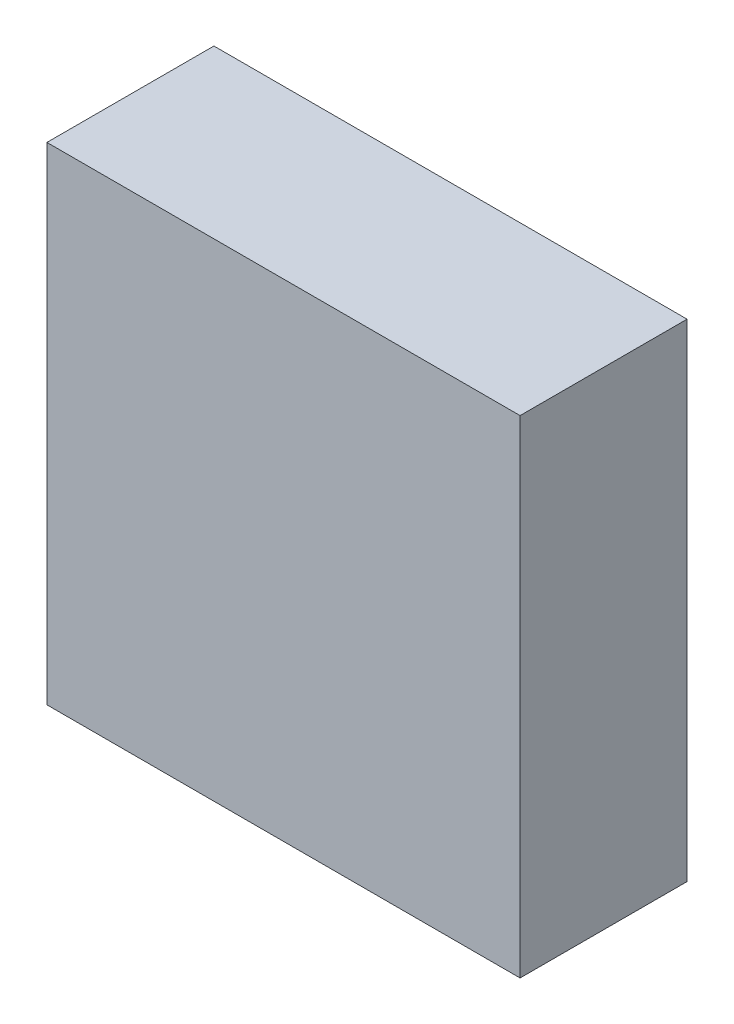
from build123d import *

# Parameters (mm, degrees)
SKETCH_1_W             = 68
SKETCH_1_H             = 70
EXTRUDE_1_DEPTH        = 24
HOLE_WIZARD_M121_D     = 10.2
HOLE_WIZARD_M121_DEPTH = 32
HOLE_WIZARD_M121_TIP   = 3.064389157
CHAMFER_1_SIZE         = 1.6


with BuildPart() as part:
    # Sketch 1 → Extrude 1 (new body)
    with BuildSketch(Plane.XY):
        Rectangle(SKETCH_1_W, SKETCH_1_H)
    extrude(amount=-EXTRUDE_1_DEPTH)

    # Hole Wizard M121
    with Locations(Plane.ZY.offset(34)):
        with Locations((-12, 23), (-12, -23)):
            Hole(HOLE_WIZARD_M121_D / 2, depth=HOLE_WIZARD_M121_DEPTH)
            with Locations((0, 0, -(HOLE_WIZARD_M121_DEPTH + HOLE_WIZARD_M121_TIP / 2))):  # 118° drill point
                Cone(0, HOLE_WIZARD_M121_D / 2, HOLE_WIZARD_M121_TIP, mode=Mode.SUBTRACT)

    # Chamfer 1
    chamfer_1_edges = [part.edges().sort_by_distance(p)[0] for p in [
        (-34, -23, -6.9),
        (-34, 23, -6.9),
    ]]
    chamfer(chamfer_1_edges, length=CHAMFER_1_SIZE)


solid = part.part
